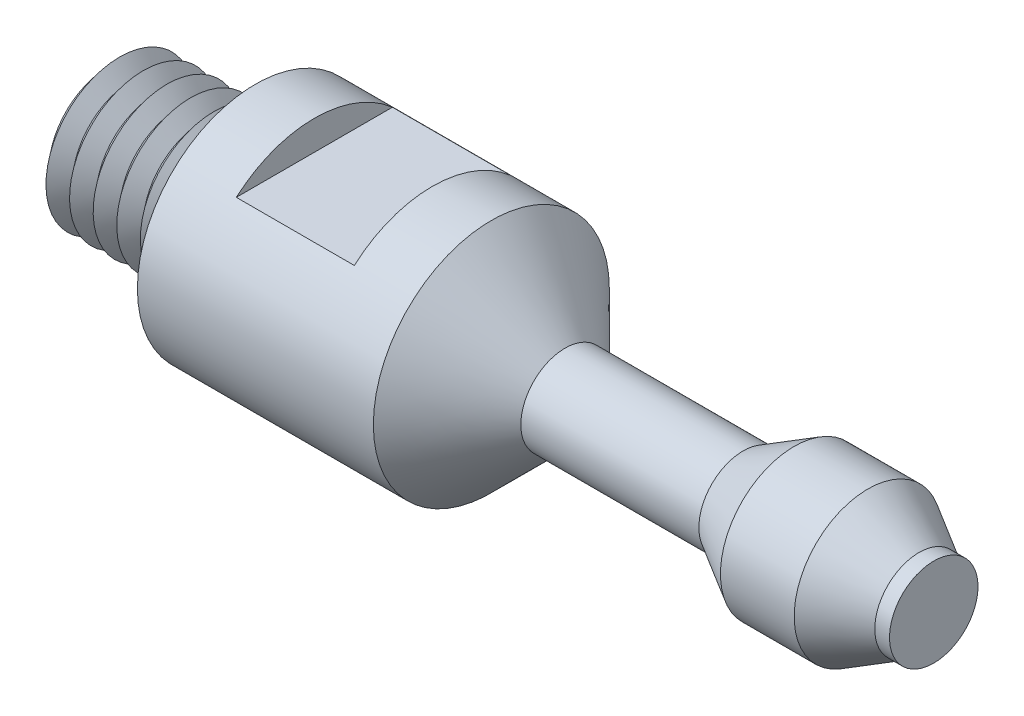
from build123d import *

# Parameters (mm, degrees)
EXTRUDE1_DEPTH      = 29.565713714
EXTRUDE1_DEPTH_BACK = 29.565713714
SKETCH3_W           = 4
SKETCH3_H           = 1.5
LPATTERN1_COUNT     = 6
LPATTERN1_PITCH     = 0.8


with BuildPart() as part:
    # Sketch1 → Revolve1 (revolve)
    with BuildSketch(Plane.XY, mode=Mode.PRIVATE) as revolve1_sk:
        Polygon((0, 0), (0, 1.5), (-0.5, 1.5), (-2.232050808, 2.5), (-4.732050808, 2.5), (-6.464101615, 1.5), (-12.5, 1.5), (-15, 4), (-23, 4), (-23, 1.8), (-24, 1.8), (-24, 2.5), (-28, 2.5), (-28, 0), align=None)
    revolve(revolve1_sk.sketch.rotate(Axis((0, 0, 0), (-1, 0, 0)), 90), axis=Axis((0, 0, 0), (-1, 0, 0)))

    # Sketch3 → Extrude1 (cut, two sides: drawn at the far end of the back side and taken through both)
    with BuildSketch(Plane.XY.offset(-EXTRUDE1_DEPTH_BACK)):
        with Locations((-19, -3.75)):
            Rectangle(SKETCH3_W, SKETCH3_H)
        with Locations((-19, 3.75)):
            Rectangle(SKETCH3_W, SKETCH3_H)
    extrude(amount=EXTRUDE1_DEPTH + EXTRUDE1_DEPTH_BACK, mode=Mode.SUBTRACT)

    # Sketch2 → Cut-Revolve1 (revolve, cut)
    with BuildSketch(Plane.XY, mode=Mode.PRIVATE) as cut_revolve1_sk:
        Polygon((-27.6, 2.5), (-28.4, 2.5), (-28, 2.00040016), align=None)
    cut_revolve1 = revolve(cut_revolve1_sk.sketch.rotate(Axis((0, 0, 0), (-1, 0, 0)), 90), axis=Axis((0, 0, 0), (-1, 0, 0)), mode=Mode.SUBTRACT)

    # LPattern1: Cut-Revolve1 ×6
    with Locations(*[(i * LPATTERN1_PITCH, 0, 0) for i in range(1, LPATTERN1_COUNT)]):
        add(cut_revolve1, mode=Mode.SUBTRACT)


solid = part.part
